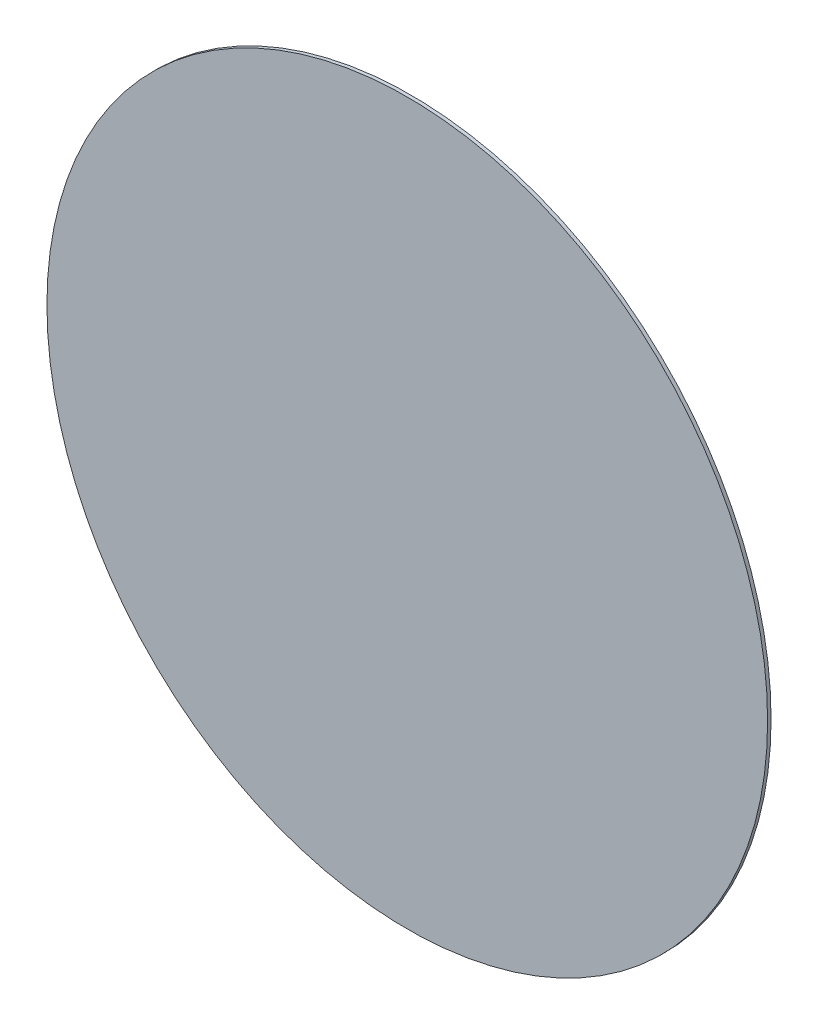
from build123d import *

# Parameters (mm, degrees)
SKETCH1_R      = 12.5
EXTRUDE1_DEPTH = 0.12


with BuildPart() as part:
    # Sketch1 → Extrude1 (new body)
    with BuildSketch(Plane.XY):
        Circle(SKETCH1_R)
    extrude(amount=EXTRUDE1_DEPTH)


solid = part.part
